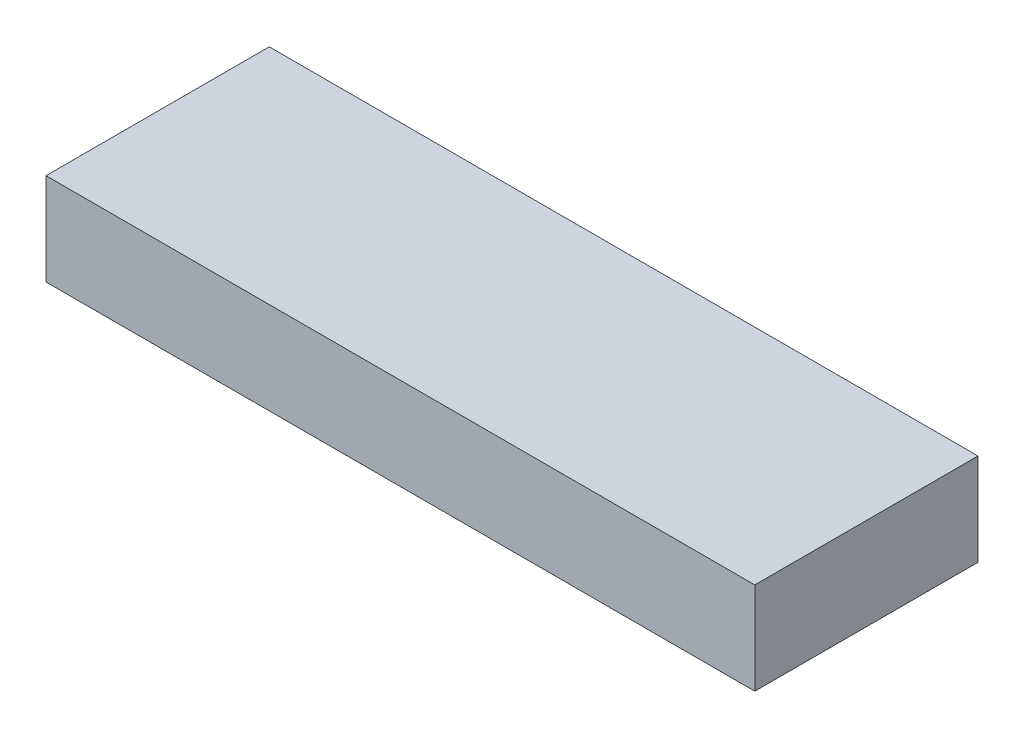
ISO-10303-21;
HEADER;
FILE_DESCRIPTION(('STEP AP214'),'2;1');
FILE_NAME('part.step','',(''),(''),'','','');
FILE_SCHEMA(('AUTOMOTIVE_DESIGN { 1 0 10303 214 1 1 1 1 }'));
ENDSEC;
DATA;
#1=APPLICATION_CONTEXT('core data for automotive mechanical design processes');
#2=APPLICATION_PROTOCOL_DEFINITION('international standard','automotive_design',2000,#1);
#3=PRODUCT_CONTEXT('',#1,'mechanical');
#4=PRODUCT('Part','Part','',(#3));
#5=PRODUCT_RELATED_PRODUCT_CATEGORY('part','',(#4));
#6=PRODUCT_DEFINITION_FORMATION('','',#4);
#7=PRODUCT_DEFINITION_CONTEXT('part definition',#1,'design');
#8=PRODUCT_DEFINITION('design','',#6,#7);
#9=PRODUCT_DEFINITION_SHAPE('','',#8);
#10=(LENGTH_UNIT() NAMED_UNIT(*) SI_UNIT(.MILLI.,.METRE.));
#11=(NAMED_UNIT(*) PLANE_ANGLE_UNIT() SI_UNIT($,.RADIAN.));
#12=(NAMED_UNIT(*) SI_UNIT($,.STERADIAN.) SOLID_ANGLE_UNIT());
#13=UNCERTAINTY_MEASURE_WITH_UNIT(LENGTH_MEASURE(1.E-05),#10,'distance_accuracy_value','');
#14=(GEOMETRIC_REPRESENTATION_CONTEXT(3) GLOBAL_UNCERTAINTY_ASSIGNED_CONTEXT((#13)) GLOBAL_UNIT_ASSIGNED_CONTEXT((#10,
#11,#12)) REPRESENTATION_CONTEXT('',''));
#15=CARTESIAN_POINT('',(0.,0.,0.));
#16=DIRECTION('',(0.,0.,1.));
#17=DIRECTION('',(1.,0.,0.));
#18=AXIS2_PLACEMENT_3D('',#15,#16,#17);
#19=CARTESIAN_POINT('',(0.,0.,0.3999992));
#20=DIRECTION('',(0.,0.,-1.));
#21=DIRECTION('',(0.,-1.,0.));
#22=AXIS2_PLACEMENT_3D('',#19,#20,#21);
#23=PLANE('',#22);
#24=DIRECTION('',(1.,0.,0.));
#25=VECTOR('',#24,1.);
#26=CARTESIAN_POINT('',(-0.635,0.08249919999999,0.3999992));
#27=LINE('',#26,#25);
#28=CARTESIAN_POINT('',(-0.635,0.08249919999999,0.3999992));
#29=VERTEX_POINT('',#28);
#30=CARTESIAN_POINT('',(0.635,0.08249919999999,0.3999992));
#31=VERTEX_POINT('',#30);
#32=EDGE_CURVE('E25',#29,#31,#27,.T.);
#33=ORIENTED_EDGE('',*,*,#32,.F.);
#34=DIRECTION('',(0.,1.,0.));
#35=VECTOR('',#34,1.);
#36=CARTESIAN_POINT('',(-0.635,-0.0824992,0.3999992));
#37=LINE('',#36,#35);
#38=CARTESIAN_POINT('',(-0.635,-0.0824992,0.3999992));
#39=VERTEX_POINT('',#38);
#40=EDGE_CURVE('E95',#39,#29,#37,.T.);
#41=ORIENTED_EDGE('',*,*,#40,.F.);
#42=DIRECTION('',(-1.,0.,0.));
#43=VECTOR('',#42,1.);
#44=CARTESIAN_POINT('',(0.635,-0.0824992,0.3999992));
#45=LINE('',#44,#43);
#46=CARTESIAN_POINT('',(0.635,-0.0824992,0.3999992));
#47=VERTEX_POINT('',#46);
#48=EDGE_CURVE('E83',#47,#39,#45,.T.);
#49=ORIENTED_EDGE('',*,*,#48,.F.);
#50=DIRECTION('',(0.,-1.,0.));
#51=VECTOR('',#50,1.);
#52=CARTESIAN_POINT('',(0.635,0.08249919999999,0.3999992));
#53=LINE('',#52,#51);
#54=EDGE_CURVE('E87',#31,#47,#53,.T.);
#55=ORIENTED_EDGE('',*,*,#54,.F.);
#56=EDGE_LOOP('',(#33,#41,#49,#55));
#57=FACE_BOUND('',#56,.T.);
#58=ADVANCED_FACE('F17',(#57),#23,.F.);
#59=CARTESIAN_POINT('',(0.,0.,0.));
#60=DIRECTION('',(0.,0.,-1.));
#61=DIRECTION('',(0.,-1.,0.));
#62=AXIS2_PLACEMENT_3D('',#59,#60,#61);
#63=PLANE('',#62);
#64=DIRECTION('',(0.,-1.,0.));
#65=VECTOR('',#64,1.);
#66=CARTESIAN_POINT('',(0.635,0.08249919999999,0.));
#67=LINE('',#66,#65);
#68=CARTESIAN_POINT('',(0.635,0.08249919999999,0.));
#69=VERTEX_POINT('',#68);
#70=CARTESIAN_POINT('',(0.635,-0.0824992,0.));
#71=VERTEX_POINT('',#70);
#72=EDGE_CURVE('E71',#69,#71,#67,.T.);
#73=ORIENTED_EDGE('',*,*,#72,.T.);
#74=DIRECTION('',(-1.,0.,0.));
#75=VECTOR('',#74,1.);
#76=CARTESIAN_POINT('',(0.635,-0.0824992,0.));
#77=LINE('',#76,#75);
#78=CARTESIAN_POINT('',(-0.635,-0.0824992,0.));
#79=VERTEX_POINT('',#78);
#80=EDGE_CURVE('E100',#71,#79,#77,.T.);
#81=ORIENTED_EDGE('',*,*,#80,.T.);
#82=DIRECTION('',(0.,1.,0.));
#83=VECTOR('',#82,1.);
#84=CARTESIAN_POINT('',(-0.635,-0.0824992,0.));
#85=LINE('',#84,#83);
#86=CARTESIAN_POINT('',(-0.635,0.08249919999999,0.));
#87=VERTEX_POINT('',#86);
#88=EDGE_CURVE('E73',#79,#87,#85,.T.);
#89=ORIENTED_EDGE('',*,*,#88,.T.);
#90=DIRECTION('',(1.,0.,0.));
#91=VECTOR('',#90,1.);
#92=CARTESIAN_POINT('',(-0.635,0.08249919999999,0.));
#93=LINE('',#92,#91);
#94=EDGE_CURVE('E11',#87,#69,#93,.T.);
#95=ORIENTED_EDGE('',*,*,#94,.T.);
#96=EDGE_LOOP('',(#73,#81,#89,#95));
#97=FACE_BOUND('',#96,.T.);
#98=ADVANCED_FACE('F69',(#97),#63,.T.);
#99=CARTESIAN_POINT('',(-0.635,0.08249919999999,0.));
#100=DIRECTION('',(0.,1.,0.));
#101=DIRECTION('',(1.,0.,0.));
#102=AXIS2_PLACEMENT_3D('',#99,#100,#101);
#103=PLANE('',#102);
#104=DIRECTION('',(0.,0.,1.));
#105=VECTOR('',#104,1.);
#106=CARTESIAN_POINT('',(-0.635,0.08249919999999,0.));
#107=LINE('',#106,#105);
#108=EDGE_CURVE('E99',#87,#29,#107,.T.);
#109=ORIENTED_EDGE('',*,*,#108,.T.);
#110=ORIENTED_EDGE('',*,*,#32,.T.);
#111=DIRECTION('',(0.,0.,1.));
#112=VECTOR('',#111,1.);
#113=CARTESIAN_POINT('',(0.635,0.08249919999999,0.));
#114=LINE('',#113,#112);
#115=EDGE_CURVE('E79',#69,#31,#114,.T.);
#116=ORIENTED_EDGE('',*,*,#115,.F.);
#117=ORIENTED_EDGE('',*,*,#94,.F.);
#118=EDGE_LOOP('',(#109,#110,#116,#117));
#119=FACE_BOUND('',#118,.T.);
#120=ADVANCED_FACE('F85',(#119),#103,.T.);
#121=CARTESIAN_POINT('',(-0.635,-0.0824992,0.));
#122=DIRECTION('',(-1.,0.,0.));
#123=DIRECTION('',(0.,0.,1.));
#124=AXIS2_PLACEMENT_3D('',#121,#122,#123);
#125=PLANE('',#124);
#126=DIRECTION('',(0.,0.,1.));
#127=VECTOR('',#126,1.);
#128=CARTESIAN_POINT('',(-0.635,-0.0824992,0.));
#129=LINE('',#128,#127);
#130=EDGE_CURVE('E106',#79,#39,#129,.T.);
#131=ORIENTED_EDGE('',*,*,#130,.T.);
#132=ORIENTED_EDGE('',*,*,#40,.T.);
#133=ORIENTED_EDGE('',*,*,#108,.F.);
#134=ORIENTED_EDGE('',*,*,#88,.F.);
#135=EDGE_LOOP('',(#131,#132,#133,#134));
#136=FACE_BOUND('',#135,.T.);
#137=ADVANCED_FACE('F169',(#136),#125,.T.);
#138=CARTESIAN_POINT('',(0.635,-0.0824992,0.));
#139=DIRECTION('',(0.,-1.,0.));
#140=DIRECTION('',(0.,0.,-1.));
#141=AXIS2_PLACEMENT_3D('',#138,#139,#140);
#142=PLANE('',#141);
#143=DIRECTION('',(0.,0.,1.));
#144=VECTOR('',#143,1.);
#145=CARTESIAN_POINT('',(0.635,-0.0824992,0.));
#146=LINE('',#145,#144);
#147=EDGE_CURVE('E81',#71,#47,#146,.T.);
#148=ORIENTED_EDGE('',*,*,#147,.T.);
#149=ORIENTED_EDGE('',*,*,#48,.T.);
#150=ORIENTED_EDGE('',*,*,#130,.F.);
#151=ORIENTED_EDGE('',*,*,#80,.F.);
#152=EDGE_LOOP('',(#148,#149,#150,#151));
#153=FACE_BOUND('',#152,.T.);
#154=ADVANCED_FACE('F159',(#153),#142,.T.);
#155=CARTESIAN_POINT('',(0.635,0.08249919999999,0.));
#156=DIRECTION('',(1.,0.,0.));
#157=DIRECTION('',(0.,1.,0.));
#158=AXIS2_PLACEMENT_3D('',#155,#156,#157);
#159=PLANE('',#158);
#160=ORIENTED_EDGE('',*,*,#115,.T.);
#161=ORIENTED_EDGE('',*,*,#54,.T.);
#162=ORIENTED_EDGE('',*,*,#147,.F.);
#163=ORIENTED_EDGE('',*,*,#72,.F.);
#164=EDGE_LOOP('',(#160,#161,#162,#163));
#165=FACE_BOUND('',#164,.T.);
#166=ADVANCED_FACE('F77',(#165),#159,.T.);
#167=CLOSED_SHELL('',(#58,#98,#120,#137,#154,#166));
#168=MANIFOLD_SOLID_BREP('B1',#167);
#169=ADVANCED_BREP_SHAPE_REPRESENTATION('',(#18,#168),#14);
#170=SHAPE_DEFINITION_REPRESENTATION(#9,#169);
ENDSEC;
END-ISO-10303-21;
